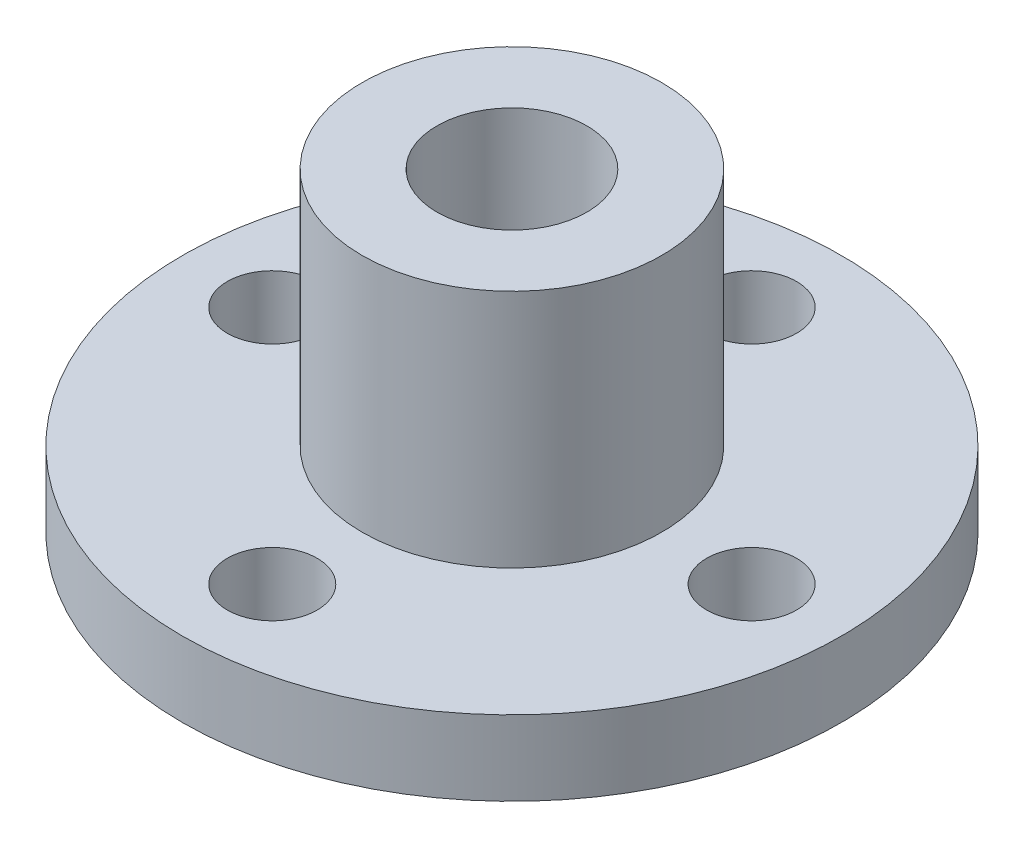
ISO-10303-21;
HEADER;
FILE_DESCRIPTION(('STEP AP214'),'2;1');
FILE_NAME('part.step','',(''),(''),'','','');
FILE_SCHEMA(('AUTOMOTIVE_DESIGN { 1 0 10303 214 1 1 1 1 }'));
ENDSEC;
DATA;
#1=APPLICATION_CONTEXT('core data for automotive mechanical design processes');
#2=APPLICATION_PROTOCOL_DEFINITION('international standard','automotive_design',2000,#1);
#3=PRODUCT_CONTEXT('',#1,'mechanical');
#4=PRODUCT('Part','Part','',(#3));
#5=PRODUCT_RELATED_PRODUCT_CATEGORY('part','',(#4));
#6=PRODUCT_DEFINITION_FORMATION('','',#4);
#7=PRODUCT_DEFINITION_CONTEXT('part definition',#1,'design');
#8=PRODUCT_DEFINITION('design','',#6,#7);
#9=PRODUCT_DEFINITION_SHAPE('','',#8);
#10=(LENGTH_UNIT() NAMED_UNIT(*) SI_UNIT(.MILLI.,.METRE.));
#11=(NAMED_UNIT(*) PLANE_ANGLE_UNIT() SI_UNIT($,.RADIAN.));
#12=(NAMED_UNIT(*) SI_UNIT($,.STERADIAN.) SOLID_ANGLE_UNIT());
#13=UNCERTAINTY_MEASURE_WITH_UNIT(LENGTH_MEASURE(1.E-05),#10,'distance_accuracy_value','');
#14=(GEOMETRIC_REPRESENTATION_CONTEXT(3) GLOBAL_UNCERTAINTY_ASSIGNED_CONTEXT((#13)) GLOBAL_UNIT_ASSIGNED_CONTEXT((#10,
#11,#12)) REPRESENTATION_CONTEXT('',''));
#15=CARTESIAN_POINT('',(0.,0.,0.));
#16=DIRECTION('',(0.,0.,1.));
#17=DIRECTION('',(1.,0.,0.));
#18=AXIS2_PLACEMENT_3D('',#15,#16,#17);
#19=CARTESIAN_POINT('',(0.,2.5,0.));
#20=DIRECTION('',(0.,-1.,0.));
#21=DIRECTION('',(0.,0.,-1.));
#22=AXIS2_PLACEMENT_3D('',#19,#20,#21);
#23=CYLINDRICAL_SURFACE('',#22,11.);
#24=CARTESIAN_POINT('',(0.,2.5,0.));
#25=DIRECTION('',(0.,1.,0.));
#26=DIRECTION('',(0.,0.,1.));
#27=AXIS2_PLACEMENT_3D('',#24,#25,#26);
#28=CIRCLE('',#27,11.);
#29=CARTESIAN_POINT('',(0.,2.5,11.));
#30=VERTEX_POINT('',#29);
#31=EDGE_CURVE('E10',#30,#30,#28,.T.);
#32=ORIENTED_EDGE('',*,*,#31,.F.);
#33=EDGE_LOOP('',(#32));
#34=FACE_BOUND('',#33,.T.);
#35=CARTESIAN_POINT('',(0.,0.,0.));
#36=DIRECTION('',(0.,1.,0.));
#37=DIRECTION('',(0.,0.,1.));
#38=AXIS2_PLACEMENT_3D('',#35,#36,#37);
#39=CIRCLE('',#38,11.);
#40=CARTESIAN_POINT('',(0.,0.,11.));
#41=VERTEX_POINT('',#40);
#42=EDGE_CURVE('E41',#41,#41,#39,.T.);
#43=ORIENTED_EDGE('',*,*,#42,.T.);
#44=EDGE_LOOP('',(#43));
#45=FACE_BOUND('',#44,.T.);
#46=ADVANCED_FACE('F34',(#34,#45),#23,.T.);
#47=CARTESIAN_POINT('',(0.,2.5,0.));
#48=DIRECTION('',(0.,1.,0.));
#49=DIRECTION('',(0.,0.,1.));
#50=AXIS2_PLACEMENT_3D('',#47,#48,#49);
#51=PLANE('',#50);
#52=CARTESIAN_POINT('',(0.,2.5,0.));
#53=DIRECTION('',(0.,1.,0.));
#54=DIRECTION('',(0.,0.,1.));
#55=AXIS2_PLACEMENT_3D('',#52,#53,#54);
#56=CIRCLE('',#55,5.);
#57=CARTESIAN_POINT('',(0.,2.5,5.));
#58=VERTEX_POINT('',#57);
#59=EDGE_CURVE('E72',#58,#58,#56,.T.);
#60=ORIENTED_EDGE('',*,*,#59,.F.);
#61=EDGE_LOOP('',(#60));
#62=FACE_BOUND('',#61,.T.);
#63=CARTESIAN_POINT('',(0.,2.5,-8.));
#64=DIRECTION('',(0.,1.,0.));
#65=DIRECTION('',(0.,0.,1.));
#66=AXIS2_PLACEMENT_3D('',#63,#64,#65);
#67=CIRCLE('',#66,1.5);
#68=CARTESIAN_POINT('',(0.,2.5,-6.5));
#69=VERTEX_POINT('',#68);
#70=EDGE_CURVE('E46',#69,#69,#67,.T.);
#71=ORIENTED_EDGE('',*,*,#70,.F.);
#72=EDGE_LOOP('',(#71));
#73=FACE_BOUND('',#72,.T.);
#74=CARTESIAN_POINT('',(8.,2.5,0.));
#75=DIRECTION('',(0.,1.,0.));
#76=DIRECTION('',(0.,0.,1.));
#77=AXIS2_PLACEMENT_3D('',#74,#75,#76);
#78=CIRCLE('',#77,1.5);
#79=CARTESIAN_POINT('',(8.,2.5,1.50000000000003));
#80=VERTEX_POINT('',#79);
#81=EDGE_CURVE('E50',#80,#80,#78,.T.);
#82=ORIENTED_EDGE('',*,*,#81,.F.);
#83=EDGE_LOOP('',(#82));
#84=FACE_BOUND('',#83,.T.);
#85=CARTESIAN_POINT('',(0.,2.5,8.));
#86=DIRECTION('',(0.,1.,0.));
#87=DIRECTION('',(0.,0.,1.));
#88=AXIS2_PLACEMENT_3D('',#85,#86,#87);
#89=CIRCLE('',#88,1.5);
#90=CARTESIAN_POINT('',(0.,2.5,9.5));
#91=VERTEX_POINT('',#90);
#92=EDGE_CURVE('E53',#91,#91,#89,.T.);
#93=ORIENTED_EDGE('',*,*,#92,.F.);
#94=EDGE_LOOP('',(#93));
#95=FACE_BOUND('',#94,.T.);
#96=CARTESIAN_POINT('',(-8.,2.5,0.));
#97=DIRECTION('',(0.,1.,0.));
#98=DIRECTION('',(0.,0.,1.));
#99=AXIS2_PLACEMENT_3D('',#96,#97,#98);
#100=CIRCLE('',#99,1.50000000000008);
#101=CARTESIAN_POINT('',(-8.,2.5,1.50000000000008));
#102=VERTEX_POINT('',#101);
#103=EDGE_CURVE('E56',#102,#102,#100,.T.);
#104=ORIENTED_EDGE('',*,*,#103,.F.);
#105=EDGE_LOOP('',(#104));
#106=FACE_BOUND('',#105,.T.);
#107=ORIENTED_EDGE('',*,*,#31,.T.);
#108=EDGE_LOOP('',(#107));
#109=FACE_BOUND('',#108,.T.);
#110=ADVANCED_FACE('F100',(#62,#73,#84,#95,#106,#109),#51,.T.);
#111=CARTESIAN_POINT('',(0.,0.,0.));
#112=DIRECTION('',(0.,1.,0.));
#113=DIRECTION('',(0.,0.,1.));
#114=AXIS2_PLACEMENT_3D('',#111,#112,#113);
#115=PLANE('',#114);
#116=CARTESIAN_POINT('',(0.,0.,0.));
#117=DIRECTION('',(0.,1.,0.));
#118=DIRECTION('',(0.,0.,1.));
#119=AXIS2_PLACEMENT_3D('',#116,#117,#118);
#120=CIRCLE('',#119,2.5);
#121=CARTESIAN_POINT('',(0.,0.,2.5));
#122=VERTEX_POINT('',#121);
#123=EDGE_CURVE('E77',#122,#122,#120,.T.);
#124=ORIENTED_EDGE('',*,*,#123,.T.);
#125=EDGE_LOOP('',(#124));
#126=FACE_BOUND('',#125,.T.);
#127=CARTESIAN_POINT('',(0.,0.,-8.));
#128=DIRECTION('',(0.,1.,0.));
#129=DIRECTION('',(0.,0.,1.));
#130=AXIS2_PLACEMENT_3D('',#127,#128,#129);
#131=CIRCLE('',#130,1.5);
#132=CARTESIAN_POINT('',(0.,0.,-6.5));
#133=VERTEX_POINT('',#132);
#134=EDGE_CURVE('E59',#133,#133,#131,.T.);
#135=ORIENTED_EDGE('',*,*,#134,.T.);
#136=EDGE_LOOP('',(#135));
#137=FACE_BOUND('',#136,.T.);
#138=CARTESIAN_POINT('',(8.,0.,0.));
#139=DIRECTION('',(0.,1.,0.));
#140=DIRECTION('',(0.,0.,1.));
#141=AXIS2_PLACEMENT_3D('',#138,#139,#140);
#142=CIRCLE('',#141,1.5);
#143=CARTESIAN_POINT('',(8.,0.,1.50000000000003));
#144=VERTEX_POINT('',#143);
#145=EDGE_CURVE('E67',#144,#144,#142,.T.);
#146=ORIENTED_EDGE('',*,*,#145,.T.);
#147=EDGE_LOOP('',(#146));
#148=FACE_BOUND('',#147,.T.);
#149=CARTESIAN_POINT('',(0.,0.,8.));
#150=DIRECTION('',(0.,1.,0.));
#151=DIRECTION('',(0.,0.,1.));
#152=AXIS2_PLACEMENT_3D('',#149,#150,#151);
#153=CIRCLE('',#152,1.5);
#154=CARTESIAN_POINT('',(0.,0.,9.5));
#155=VERTEX_POINT('',#154);
#156=EDGE_CURVE('E63',#155,#155,#153,.T.);
#157=ORIENTED_EDGE('',*,*,#156,.T.);
#158=EDGE_LOOP('',(#157));
#159=FACE_BOUND('',#158,.T.);
#160=CARTESIAN_POINT('',(-8.,0.,0.));
#161=DIRECTION('',(0.,1.,0.));
#162=DIRECTION('',(0.,0.,1.));
#163=AXIS2_PLACEMENT_3D('',#160,#161,#162);
#164=CIRCLE('',#163,1.50000000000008);
#165=CARTESIAN_POINT('',(-8.,0.,1.50000000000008));
#166=VERTEX_POINT('',#165);
#167=EDGE_CURVE('E60',#166,#166,#164,.T.);
#168=ORIENTED_EDGE('',*,*,#167,.T.);
#169=EDGE_LOOP('',(#168));
#170=FACE_BOUND('',#169,.T.);
#171=ORIENTED_EDGE('',*,*,#42,.F.);
#172=EDGE_LOOP('',(#171));
#173=FACE_BOUND('',#172,.T.);
#174=ADVANCED_FACE('F103',(#126,#137,#148,#159,#170,#173),#115,.F.);
#175=CARTESIAN_POINT('',(-8.,0.,0.));
#176=DIRECTION('',(0.,1.,0.));
#177=DIRECTION('',(0.,0.,1.));
#178=AXIS2_PLACEMENT_3D('',#175,#176,#177);
#179=CYLINDRICAL_SURFACE('',#178,1.50000000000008);
#180=ORIENTED_EDGE('',*,*,#103,.T.);
#181=EDGE_LOOP('',(#180));
#182=FACE_BOUND('',#181,.T.);
#183=ORIENTED_EDGE('',*,*,#167,.F.);
#184=EDGE_LOOP('',(#183));
#185=FACE_BOUND('',#184,.T.);
#186=ADVANCED_FACE('F113',(#182,#185),#179,.F.);
#187=CARTESIAN_POINT('',(0.,0.,8.));
#188=DIRECTION('',(0.,1.,0.));
#189=DIRECTION('',(0.,0.,1.));
#190=AXIS2_PLACEMENT_3D('',#187,#188,#189);
#191=CYLINDRICAL_SURFACE('',#190,1.5);
#192=ORIENTED_EDGE('',*,*,#92,.T.);
#193=EDGE_LOOP('',(#192));
#194=FACE_BOUND('',#193,.T.);
#195=ORIENTED_EDGE('',*,*,#156,.F.);
#196=EDGE_LOOP('',(#195));
#197=FACE_BOUND('',#196,.T.);
#198=ADVANCED_FACE('F116',(#194,#197),#191,.F.);
#199=CARTESIAN_POINT('',(8.,0.,0.));
#200=DIRECTION('',(0.,1.,0.));
#201=DIRECTION('',(0.,0.,1.));
#202=AXIS2_PLACEMENT_3D('',#199,#200,#201);
#203=CYLINDRICAL_SURFACE('',#202,1.5);
#204=ORIENTED_EDGE('',*,*,#81,.T.);
#205=EDGE_LOOP('',(#204));
#206=FACE_BOUND('',#205,.T.);
#207=ORIENTED_EDGE('',*,*,#145,.F.);
#208=EDGE_LOOP('',(#207));
#209=FACE_BOUND('',#208,.T.);
#210=ADVANCED_FACE('F149',(#206,#209),#203,.F.);
#211=CARTESIAN_POINT('',(0.,0.,-8.));
#212=DIRECTION('',(0.,1.,0.));
#213=DIRECTION('',(0.,0.,1.));
#214=AXIS2_PLACEMENT_3D('',#211,#212,#213);
#215=CYLINDRICAL_SURFACE('',#214,1.5);
#216=ORIENTED_EDGE('',*,*,#70,.T.);
#217=EDGE_LOOP('',(#216));
#218=FACE_BOUND('',#217,.T.);
#219=ORIENTED_EDGE('',*,*,#134,.F.);
#220=EDGE_LOOP('',(#219));
#221=FACE_BOUND('',#220,.T.);
#222=ADVANCED_FACE('F96',(#218,#221),#215,.F.);
#223=CARTESIAN_POINT('',(0.,10.5,0.));
#224=DIRECTION('',(0.,-1.,0.));
#225=DIRECTION('',(0.,0.,-1.));
#226=AXIS2_PLACEMENT_3D('',#223,#224,#225);
#227=CYLINDRICAL_SURFACE('',#226,5.);
#228=CARTESIAN_POINT('',(0.,10.5,0.));
#229=DIRECTION('',(0.,1.,0.));
#230=DIRECTION('',(0.,0.,1.));
#231=AXIS2_PLACEMENT_3D('',#228,#229,#230);
#232=CIRCLE('',#231,5.);
#233=CARTESIAN_POINT('',(0.,10.5,5.));
#234=VERTEX_POINT('',#233);
#235=EDGE_CURVE('E64',#234,#234,#232,.T.);
#236=ORIENTED_EDGE('',*,*,#235,.F.);
#237=EDGE_LOOP('',(#236));
#238=FACE_BOUND('',#237,.T.);
#239=ORIENTED_EDGE('',*,*,#59,.T.);
#240=EDGE_LOOP('',(#239));
#241=FACE_BOUND('',#240,.T.);
#242=ADVANCED_FACE('F90',(#238,#241),#227,.T.);
#243=CARTESIAN_POINT('',(0.,10.5,0.));
#244=DIRECTION('',(0.,1.,0.));
#245=DIRECTION('',(0.,0.,1.));
#246=AXIS2_PLACEMENT_3D('',#243,#244,#245);
#247=PLANE('',#246);
#248=CARTESIAN_POINT('',(0.,10.5,0.));
#249=DIRECTION('',(0.,1.,0.));
#250=DIRECTION('',(0.,0.,1.));
#251=AXIS2_PLACEMENT_3D('',#248,#249,#250);
#252=CIRCLE('',#251,2.5);
#253=CARTESIAN_POINT('',(0.,10.5,2.5));
#254=VERTEX_POINT('',#253);
#255=EDGE_CURVE('E37',#254,#254,#252,.T.);
#256=ORIENTED_EDGE('',*,*,#255,.F.);
#257=EDGE_LOOP('',(#256));
#258=FACE_BOUND('',#257,.T.);
#259=ORIENTED_EDGE('',*,*,#235,.T.);
#260=EDGE_LOOP('',(#259));
#261=FACE_BOUND('',#260,.T.);
#262=ADVANCED_FACE('F87',(#258,#261),#247,.T.);
#263=CARTESIAN_POINT('',(0.,0.,0.));
#264=DIRECTION('',(0.,1.,0.));
#265=DIRECTION('',(0.,0.,1.));
#266=AXIS2_PLACEMENT_3D('',#263,#264,#265);
#267=CYLINDRICAL_SURFACE('',#266,2.5);
#268=CARTESIAN_POINT('',(0.,10.5,2.5));
#269=CARTESIAN_POINT('',(0.,10.390625,2.5));
#270=CARTESIAN_POINT('',(0.,10.28125,2.5));
#271=CARTESIAN_POINT('',(0.,10.0625,2.5));
#272=CARTESIAN_POINT('',(0.,9.953125,2.5));
#273=CARTESIAN_POINT('',(0.,9.734375,2.5));
#274=CARTESIAN_POINT('',(0.,9.625,2.5));
#275=CARTESIAN_POINT('',(0.,9.40625,2.5));
#276=CARTESIAN_POINT('',(0.,9.296875,2.5));
#277=CARTESIAN_POINT('',(0.,9.078125,2.5));
#278=CARTESIAN_POINT('',(0.,8.96875,2.5));
#279=CARTESIAN_POINT('',(0.,8.75,2.5));
#280=CARTESIAN_POINT('',(0.,8.640625,2.5));
#281=CARTESIAN_POINT('',(0.,8.421875,2.5));
#282=CARTESIAN_POINT('',(0.,8.3125,2.5));
#283=CARTESIAN_POINT('',(0.,8.09375,2.5));
#284=CARTESIAN_POINT('',(0.,7.984375,2.5));
#285=CARTESIAN_POINT('',(0.,7.765625,2.5));
#286=CARTESIAN_POINT('',(0.,7.65625,2.5));
#287=CARTESIAN_POINT('',(0.,7.4375,2.5));
#288=CARTESIAN_POINT('',(0.,7.328125,2.5));
#289=CARTESIAN_POINT('',(0.,7.109375,2.5));
#290=CARTESIAN_POINT('',(0.,7.,2.5));
#291=CARTESIAN_POINT('',(0.,6.78125,2.5));
#292=CARTESIAN_POINT('',(0.,6.671875,2.5));
#293=CARTESIAN_POINT('',(0.,6.453125,2.5));
#294=CARTESIAN_POINT('',(0.,6.34375,2.5));
#295=CARTESIAN_POINT('',(0.,6.125,2.5));
#296=CARTESIAN_POINT('',(0.,6.015625,2.5));
#297=CARTESIAN_POINT('',(0.,5.796875,2.5));
#298=CARTESIAN_POINT('',(0.,5.6875,2.5));
#299=CARTESIAN_POINT('',(0.,5.46875,2.5));
#300=CARTESIAN_POINT('',(0.,5.359375,2.5));
#301=CARTESIAN_POINT('',(0.,5.140625,2.5));
#302=CARTESIAN_POINT('',(0.,5.03125,2.5));
#303=CARTESIAN_POINT('',(0.,4.8125,2.5));
#304=CARTESIAN_POINT('',(0.,4.703125,2.5));
#305=CARTESIAN_POINT('',(0.,4.484375,2.5));
#306=CARTESIAN_POINT('',(0.,4.375,2.5));
#307=CARTESIAN_POINT('',(0.,4.15625,2.5));
#308=CARTESIAN_POINT('',(0.,4.046875,2.5));
#309=CARTESIAN_POINT('',(0.,3.828125,2.5));
#310=CARTESIAN_POINT('',(0.,3.71875,2.5));
#311=CARTESIAN_POINT('',(0.,3.5,2.5));
#312=CARTESIAN_POINT('',(0.,3.390625,2.5));
#313=CARTESIAN_POINT('',(0.,3.171875,2.5));
#314=CARTESIAN_POINT('',(0.,3.0625,2.5));
#315=CARTESIAN_POINT('',(0.,2.84375,2.5));
#316=CARTESIAN_POINT('',(0.,2.734375,2.5));
#317=CARTESIAN_POINT('',(0.,2.515625,2.5));
#318=CARTESIAN_POINT('',(0.,2.40625,2.5));
#319=CARTESIAN_POINT('',(0.,2.1875,2.5));
#320=CARTESIAN_POINT('',(0.,2.078125,2.5));
#321=CARTESIAN_POINT('',(0.,1.859375,2.5));
#322=CARTESIAN_POINT('',(0.,1.75,2.5));
#323=CARTESIAN_POINT('',(0.,1.53125,2.5));
#324=CARTESIAN_POINT('',(0.,1.421875,2.5));
#325=CARTESIAN_POINT('',(0.,1.203125,2.5));
#326=CARTESIAN_POINT('',(0.,1.09375,2.5));
#327=CARTESIAN_POINT('',(0.,0.875000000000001,2.5));
#328=CARTESIAN_POINT('',(0.,0.765625,2.5));
#329=CARTESIAN_POINT('',(0.,0.546875,2.5));
#330=CARTESIAN_POINT('',(0.,0.4375,2.5));
#331=CARTESIAN_POINT('',(0.,0.21875,2.5));
#332=CARTESIAN_POINT('',(0.,0.109375,2.5));
#333=CARTESIAN_POINT('',(0.,0.,2.5));
#334=B_SPLINE_CURVE_WITH_KNOTS('',3,(#268,#269,#270,#271,#272,#273,#274,#275,#276,#277,#278,
#279,#280,#281,#282,#283,#284,#285,#286,#287,#288,#289,#290,#291,#292,#293,#294,#295,#296,#297,
#298,#299,#300,#301,#302,#303,#304,#305,#306,#307,#308,#309,#310,#311,#312,#313,#314,#315,#316,
#317,#318,#319,#320,#321,#322,#323,#324,#325,#326,#327,#328,#329,#330,#331,#332,#333),
.UNSPECIFIED.,.F.,.F.,(4,2,2,2,2,2,2,2,2,2,2,2,2,2,2,2,2,2,2,2,2,2,2,2,2,2,2,2,2,2,2,2,4),(0.,
0.328125,0.656250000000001,0.984375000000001,1.3125,1.640625,1.96875,2.296875,2.625,2.953125,
3.28125,3.609375,3.9375,4.265625,4.59375,4.921875,5.25,5.578125,5.90625,6.234375,6.5625,
6.890625,7.21875,7.546875,7.875,8.203125,8.53125,8.859375,9.1875,9.515625,9.84375,10.171875,
10.5),.UNSPECIFIED.);
#335=EDGE_CURVE('BSEAM84',#254,#122,#334,.T.);
#336=ORIENTED_EDGE('',*,*,#255,.T.);
#337=ORIENTED_EDGE('',*,*,#123,.F.);
#338=ORIENTED_EDGE('',*,*,#335,.T.);
#339=ORIENTED_EDGE('',*,*,#335,.F.);
#340=EDGE_LOOP('',(#336,#338,#337,#339));
#341=FACE_BOUND('',#340,.T.);
#342=ADVANCED_FACE('F84',(#341),#267,.F.);
#343=CLOSED_SHELL('',(#46,#110,#174,#186,#198,#210,#222,#242,#262,#342));
#344=MANIFOLD_SOLID_BREP('B2',#343);
#345=ADVANCED_BREP_SHAPE_REPRESENTATION('',(#18,#344),#14);
#346=SHAPE_DEFINITION_REPRESENTATION(#9,#345);
ENDSEC;
END-ISO-10303-21;
